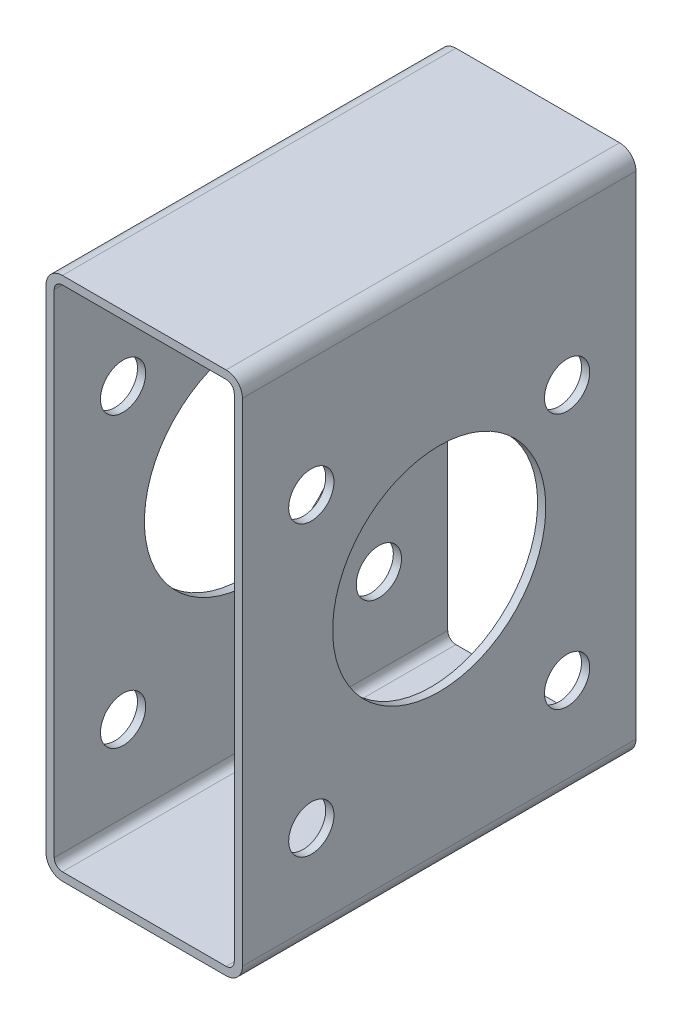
ISO-10303-21;
HEADER;
FILE_DESCRIPTION(('STEP AP214'),'2;1');
FILE_NAME('part.step','',(''),(''),'','','');
FILE_SCHEMA(('AUTOMOTIVE_DESIGN { 1 0 10303 214 1 1 1 1 }'));
ENDSEC;
DATA;
#1=APPLICATION_CONTEXT('core data for automotive mechanical design processes');
#2=APPLICATION_PROTOCOL_DEFINITION('international standard','automotive_design',2000,#1);
#3=PRODUCT_CONTEXT('',#1,'mechanical');
#4=PRODUCT('Part','Part','',(#3));
#5=PRODUCT_RELATED_PRODUCT_CATEGORY('part','',(#4));
#6=PRODUCT_DEFINITION_FORMATION('','',#4);
#7=PRODUCT_DEFINITION_CONTEXT('part definition',#1,'design');
#8=PRODUCT_DEFINITION('design','',#6,#7);
#9=PRODUCT_DEFINITION_SHAPE('','',#8);
#10=(LENGTH_UNIT() NAMED_UNIT(*) SI_UNIT(.MILLI.,.METRE.));
#11=(NAMED_UNIT(*) PLANE_ANGLE_UNIT() SI_UNIT($,.RADIAN.));
#12=(NAMED_UNIT(*) SI_UNIT($,.STERADIAN.) SOLID_ANGLE_UNIT());
#13=UNCERTAINTY_MEASURE_WITH_UNIT(LENGTH_MEASURE(1.E-05),#10,'distance_accuracy_value','');
#14=(GEOMETRIC_REPRESENTATION_CONTEXT(3) GLOBAL_UNCERTAINTY_ASSIGNED_CONTEXT((#13)) GLOBAL_UNIT_ASSIGNED_CONTEXT((#10,
#11,#12)) REPRESENTATION_CONTEXT('',''));
#15=CARTESIAN_POINT('',(0.,0.,0.));
#16=DIRECTION('',(0.,0.,1.));
#17=DIRECTION('',(1.,0.,0.));
#18=AXIS2_PLACEMENT_3D('',#15,#16,#17);
#19=CARTESIAN_POINT('',(-31.75,-82.55,152.4));
#20=DIRECTION('',(0.,0.,1.));
#21=DIRECTION('',(1.,0.,0.));
#22=AXIS2_PLACEMENT_3D('',#19,#20,#21);
#23=PLANE('',#22);
#24=CARTESIAN_POINT('',(-31.75,-82.55,152.4));
#25=DIRECTION('',(0.,0.,1.));
#26=DIRECTION('',(1.,0.,0.));
#27=AXIS2_PLACEMENT_3D('',#24,#25,#26);
#28=CIRCLE('',#27,6.35000000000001);
#29=CARTESIAN_POINT('',(-38.1,-82.55,152.4));
#30=VERTEX_POINT('',#29);
#31=CARTESIAN_POINT('',(-31.75,-88.9,152.4));
#32=VERTEX_POINT('',#31);
#33=EDGE_CURVE('E210',#30,#32,#28,.T.);
#34=ORIENTED_EDGE('',*,*,#33,.T.);
#35=DIRECTION('',(1.,0.,0.));
#36=VECTOR('',#35,1.);
#37=CARTESIAN_POINT('',(-31.75,-88.9,152.4));
#38=LINE('',#37,#36);
#39=CARTESIAN_POINT('',(31.623,-88.9,152.4));
#40=VERTEX_POINT('',#39);
#41=EDGE_CURVE('E213',#32,#40,#38,.T.);
#42=ORIENTED_EDGE('',*,*,#41,.T.);
#43=CARTESIAN_POINT('',(31.623,-82.55,152.4));
#44=DIRECTION('',(0.,0.,1.));
#45=DIRECTION('',(-1.,0.,0.));
#46=AXIS2_PLACEMENT_3D('',#43,#44,#45);
#47=CIRCLE('',#46,6.34999999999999);
#48=CARTESIAN_POINT('',(37.973,-82.55,152.4));
#49=VERTEX_POINT('',#48);
#50=EDGE_CURVE('E216',#40,#49,#47,.T.);
#51=ORIENTED_EDGE('',*,*,#50,.T.);
#52=DIRECTION('',(0.,1.,0.));
#53=VECTOR('',#52,1.);
#54=CARTESIAN_POINT('',(37.973,-82.55,152.4));
#55=LINE('',#54,#53);
#56=CARTESIAN_POINT('',(37.973,107.95,152.4));
#57=VERTEX_POINT('',#56);
#58=EDGE_CURVE('E218',#49,#57,#55,.T.);
#59=ORIENTED_EDGE('',*,*,#58,.T.);
#60=CARTESIAN_POINT('',(31.623,107.95,152.4));
#61=DIRECTION('',(0.,0.,1.));
#62=DIRECTION('',(1.,0.,0.));
#63=AXIS2_PLACEMENT_3D('',#60,#61,#62);
#64=CIRCLE('',#63,6.35);
#65=CARTESIAN_POINT('',(31.623,114.3,152.4));
#66=VERTEX_POINT('',#65);
#67=EDGE_CURVE('E220',#57,#66,#64,.T.);
#68=ORIENTED_EDGE('',*,*,#67,.T.);
#69=DIRECTION('',(-1.,0.,0.));
#70=VECTOR('',#69,1.);
#71=CARTESIAN_POINT('',(-31.75,114.3,152.4));
#72=LINE('',#71,#70);
#73=CARTESIAN_POINT('',(-31.75,114.3,152.4));
#74=VERTEX_POINT('',#73);
#75=EDGE_CURVE('E222',#66,#74,#72,.T.);
#76=ORIENTED_EDGE('',*,*,#75,.T.);
#77=CARTESIAN_POINT('',(-31.75,107.95,152.4));
#78=DIRECTION('',(0.,0.,1.));
#79=DIRECTION('',(1.,0.,0.));
#80=AXIS2_PLACEMENT_3D('',#77,#78,#79);
#81=CIRCLE('',#80,6.35);
#82=CARTESIAN_POINT('',(-38.1,107.95,152.4));
#83=VERTEX_POINT('',#82);
#84=EDGE_CURVE('E224',#74,#83,#81,.T.);
#85=ORIENTED_EDGE('',*,*,#84,.T.);
#86=DIRECTION('',(0.,-1.,0.));
#87=VECTOR('',#86,1.);
#88=CARTESIAN_POINT('',(-38.1,-82.55,152.4));
#89=LINE('',#88,#87);
#90=EDGE_CURVE('E226',#83,#30,#89,.T.);
#91=ORIENTED_EDGE('',*,*,#90,.T.);
#92=EDGE_LOOP('',(#34,#42,#51,#59,#68,#76,#85,#91));
#93=FACE_BOUND('',#92,.T.);
#94=DIRECTION('',(1.,0.,0.));
#95=VECTOR('',#94,1.);
#96=CARTESIAN_POINT('',(-31.75,-85.725,152.4));
#97=LINE('',#96,#95);
#98=CARTESIAN_POINT('',(-31.75,-85.725,152.4));
#99=VERTEX_POINT('',#98);
#100=CARTESIAN_POINT('',(31.623,-85.725,152.4));
#101=VERTEX_POINT('',#100);
#102=EDGE_CURVE('E151',#99,#101,#97,.T.);
#103=ORIENTED_EDGE('',*,*,#102,.F.);
#104=CARTESIAN_POINT('',(-31.75,-82.55,152.4));
#105=DIRECTION('',(0.,0.,1.));
#106=DIRECTION('',(1.,0.,0.));
#107=AXIS2_PLACEMENT_3D('',#104,#105,#106);
#108=CIRCLE('',#107,3.175);
#109=CARTESIAN_POINT('',(-34.925,-82.55,152.4));
#110=VERTEX_POINT('',#109);
#111=EDGE_CURVE('E143',#110,#99,#108,.T.);
#112=ORIENTED_EDGE('',*,*,#111,.F.);
#113=DIRECTION('',(0.,-1.,0.));
#114=VECTOR('',#113,1.);
#115=CARTESIAN_POINT('',(-34.925,-82.55,152.4));
#116=LINE('',#115,#114);
#117=CARTESIAN_POINT('',(-34.925,107.95,152.4));
#118=VERTEX_POINT('',#117);
#119=EDGE_CURVE('E177',#118,#110,#116,.T.);
#120=ORIENTED_EDGE('',*,*,#119,.F.);
#121=CARTESIAN_POINT('',(-31.75,107.95,152.4));
#122=DIRECTION('',(0.,0.,1.));
#123=DIRECTION('',(1.,0.,0.));
#124=AXIS2_PLACEMENT_3D('',#121,#122,#123);
#125=CIRCLE('',#124,3.175);
#126=CARTESIAN_POINT('',(-31.75,111.125,152.4));
#127=VERTEX_POINT('',#126);
#128=EDGE_CURVE('E175',#127,#118,#125,.T.);
#129=ORIENTED_EDGE('',*,*,#128,.F.);
#130=DIRECTION('',(-1.,0.,0.));
#131=VECTOR('',#130,1.);
#132=CARTESIAN_POINT('',(-31.75,111.125,152.4));
#133=LINE('',#132,#131);
#134=CARTESIAN_POINT('',(31.623,111.125,152.4));
#135=VERTEX_POINT('',#134);
#136=EDGE_CURVE('E173',#135,#127,#133,.T.);
#137=ORIENTED_EDGE('',*,*,#136,.F.);
#138=CARTESIAN_POINT('',(31.623,107.95,152.4));
#139=DIRECTION('',(0.,0.,1.));
#140=DIRECTION('',(1.,0.,0.));
#141=AXIS2_PLACEMENT_3D('',#138,#139,#140);
#142=CIRCLE('',#141,3.175);
#143=CARTESIAN_POINT('',(34.798,107.95,152.4));
#144=VERTEX_POINT('',#143);
#145=EDGE_CURVE('E171',#144,#135,#142,.T.);
#146=ORIENTED_EDGE('',*,*,#145,.F.);
#147=DIRECTION('',(0.,1.,0.));
#148=VECTOR('',#147,1.);
#149=CARTESIAN_POINT('',(34.798,-82.55,152.4));
#150=LINE('',#149,#148);
#151=CARTESIAN_POINT('',(34.798,-82.55,152.4));
#152=VERTEX_POINT('',#151);
#153=EDGE_CURVE('E166',#152,#144,#150,.T.);
#154=ORIENTED_EDGE('',*,*,#153,.F.);
#155=CARTESIAN_POINT('',(31.623,-82.55,152.4));
#156=DIRECTION('',(0.,0.,1.));
#157=DIRECTION('',(-1.,0.,0.));
#158=AXIS2_PLACEMENT_3D('',#155,#156,#157);
#159=CIRCLE('',#158,3.17500000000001);
#160=EDGE_CURVE('E164',#101,#152,#159,.T.);
#161=ORIENTED_EDGE('',*,*,#160,.F.);
#162=EDGE_LOOP('',(#103,#112,#120,#129,#137,#146,#154,#161));
#163=FACE_BOUND('',#162,.T.);
#164=ADVANCED_FACE('F30',(#93,#163),#23,.T.);
#165=CARTESIAN_POINT('',(-31.75,-82.55,0.));
#166=DIRECTION('',(0.,0.,1.));
#167=DIRECTION('',(1.,0.,0.));
#168=AXIS2_PLACEMENT_3D('',#165,#166,#167);
#169=PLANE('',#168);
#170=CARTESIAN_POINT('',(-31.75,-82.55,0.));
#171=DIRECTION('',(0.,0.,1.));
#172=DIRECTION('',(1.,0.,0.));
#173=AXIS2_PLACEMENT_3D('',#170,#171,#172);
#174=CIRCLE('',#173,6.35000000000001);
#175=CARTESIAN_POINT('',(-38.1,-82.55,0.));
#176=VERTEX_POINT('',#175);
#177=CARTESIAN_POINT('',(-31.75,-88.9,0.));
#178=VERTEX_POINT('',#177);
#179=EDGE_CURVE('E159',#176,#178,#174,.T.);
#180=ORIENTED_EDGE('',*,*,#179,.F.);
#181=DIRECTION('',(0.,-1.,0.));
#182=VECTOR('',#181,1.);
#183=CARTESIAN_POINT('',(-38.1,-82.55,0.));
#184=LINE('',#183,#182);
#185=CARTESIAN_POINT('',(-38.1,107.95,0.));
#186=VERTEX_POINT('',#185);
#187=EDGE_CURVE('E214',#186,#176,#184,.T.);
#188=ORIENTED_EDGE('',*,*,#187,.F.);
#189=CARTESIAN_POINT('',(-31.75,107.95,0.));
#190=DIRECTION('',(0.,0.,1.));
#191=DIRECTION('',(1.,0.,0.));
#192=AXIS2_PLACEMENT_3D('',#189,#190,#191);
#193=CIRCLE('',#192,6.35);
#194=CARTESIAN_POINT('',(-31.75,114.3,0.));
#195=VERTEX_POINT('',#194);
#196=EDGE_CURVE('E241',#195,#186,#193,.T.);
#197=ORIENTED_EDGE('',*,*,#196,.F.);
#198=DIRECTION('',(-1.,0.,0.));
#199=VECTOR('',#198,1.);
#200=CARTESIAN_POINT('',(-31.75,114.3,0.));
#201=LINE('',#200,#199);
#202=CARTESIAN_POINT('',(31.623,114.3,0.));
#203=VERTEX_POINT('',#202);
#204=EDGE_CURVE('E239',#203,#195,#201,.T.);
#205=ORIENTED_EDGE('',*,*,#204,.F.);
#206=CARTESIAN_POINT('',(31.623,107.95,0.));
#207=DIRECTION('',(0.,0.,1.));
#208=DIRECTION('',(1.,0.,0.));
#209=AXIS2_PLACEMENT_3D('',#206,#207,#208);
#210=CIRCLE('',#209,6.35);
#211=CARTESIAN_POINT('',(37.973,107.95,0.));
#212=VERTEX_POINT('',#211);
#213=EDGE_CURVE('E237',#212,#203,#210,.T.);
#214=ORIENTED_EDGE('',*,*,#213,.F.);
#215=DIRECTION('',(0.,1.,0.));
#216=VECTOR('',#215,1.);
#217=CARTESIAN_POINT('',(37.973,-82.55,0.));
#218=LINE('',#217,#216);
#219=CARTESIAN_POINT('',(37.973,-82.55,0.));
#220=VERTEX_POINT('',#219);
#221=EDGE_CURVE('E235',#220,#212,#218,.T.);
#222=ORIENTED_EDGE('',*,*,#221,.F.);
#223=CARTESIAN_POINT('',(31.623,-82.55,0.));
#224=DIRECTION('',(0.,0.,1.));
#225=DIRECTION('',(-1.,0.,0.));
#226=AXIS2_PLACEMENT_3D('',#223,#224,#225);
#227=CIRCLE('',#226,6.34999999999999);
#228=CARTESIAN_POINT('',(31.623,-88.9,0.));
#229=VERTEX_POINT('',#228);
#230=EDGE_CURVE('E233',#229,#220,#227,.T.);
#231=ORIENTED_EDGE('',*,*,#230,.F.);
#232=DIRECTION('',(1.,0.,0.));
#233=VECTOR('',#232,1.);
#234=CARTESIAN_POINT('',(-31.75,-88.9,0.));
#235=LINE('',#234,#233);
#236=EDGE_CURVE('E231',#178,#229,#235,.T.);
#237=ORIENTED_EDGE('',*,*,#236,.F.);
#238=EDGE_LOOP('',(#180,#188,#197,#205,#214,#222,#231,#237));
#239=FACE_BOUND('',#238,.T.);
#240=CARTESIAN_POINT('',(-31.75,-82.55,0.));
#241=DIRECTION('',(0.,0.,1.));
#242=DIRECTION('',(1.,0.,0.));
#243=AXIS2_PLACEMENT_3D('',#240,#241,#242);
#244=CIRCLE('',#243,3.175);
#245=CARTESIAN_POINT('',(-34.925,-82.55,0.));
#246=VERTEX_POINT('',#245);
#247=CARTESIAN_POINT('',(-31.75,-85.725,0.));
#248=VERTEX_POINT('',#247);
#249=EDGE_CURVE('E53',#246,#248,#244,.T.);
#250=ORIENTED_EDGE('',*,*,#249,.T.);
#251=DIRECTION('',(1.,0.,0.));
#252=VECTOR('',#251,1.);
#253=CARTESIAN_POINT('',(-31.75,-85.725,0.));
#254=LINE('',#253,#252);
#255=CARTESIAN_POINT('',(31.623,-85.725,0.));
#256=VERTEX_POINT('',#255);
#257=EDGE_CURVE('E158',#248,#256,#254,.T.);
#258=ORIENTED_EDGE('',*,*,#257,.T.);
#259=CARTESIAN_POINT('',(31.623,-82.55,0.));
#260=DIRECTION('',(0.,0.,1.));
#261=DIRECTION('',(-1.,0.,0.));
#262=AXIS2_PLACEMENT_3D('',#259,#260,#261);
#263=CIRCLE('',#262,3.17500000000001);
#264=CARTESIAN_POINT('',(34.798,-82.55,0.));
#265=VERTEX_POINT('',#264);
#266=EDGE_CURVE('E182',#256,#265,#263,.T.);
#267=ORIENTED_EDGE('',*,*,#266,.T.);
#268=DIRECTION('',(0.,1.,0.));
#269=VECTOR('',#268,1.);
#270=CARTESIAN_POINT('',(34.798,-82.55,0.));
#271=LINE('',#270,#269);
#272=CARTESIAN_POINT('',(34.798,107.95,0.));
#273=VERTEX_POINT('',#272);
#274=EDGE_CURVE('E185',#265,#273,#271,.T.);
#275=ORIENTED_EDGE('',*,*,#274,.T.);
#276=CARTESIAN_POINT('',(31.623,107.95,0.));
#277=DIRECTION('',(0.,0.,1.));
#278=DIRECTION('',(1.,0.,0.));
#279=AXIS2_PLACEMENT_3D('',#276,#277,#278);
#280=CIRCLE('',#279,3.175);
#281=CARTESIAN_POINT('',(31.623,111.125,0.));
#282=VERTEX_POINT('',#281);
#283=EDGE_CURVE('E188',#273,#282,#280,.T.);
#284=ORIENTED_EDGE('',*,*,#283,.T.);
#285=DIRECTION('',(-1.,0.,0.));
#286=VECTOR('',#285,1.);
#287=CARTESIAN_POINT('',(-31.75,111.125,0.));
#288=LINE('',#287,#286);
#289=CARTESIAN_POINT('',(-31.75,111.125,0.));
#290=VERTEX_POINT('',#289);
#291=EDGE_CURVE('E191',#282,#290,#288,.T.);
#292=ORIENTED_EDGE('',*,*,#291,.T.);
#293=CARTESIAN_POINT('',(-31.75,107.95,0.));
#294=DIRECTION('',(0.,0.,1.));
#295=DIRECTION('',(1.,0.,0.));
#296=AXIS2_PLACEMENT_3D('',#293,#294,#295);
#297=CIRCLE('',#296,3.175);
#298=CARTESIAN_POINT('',(-34.925,107.95,0.));
#299=VERTEX_POINT('',#298);
#300=EDGE_CURVE('E194',#290,#299,#297,.T.);
#301=ORIENTED_EDGE('',*,*,#300,.T.);
#302=DIRECTION('',(0.,-1.,0.));
#303=VECTOR('',#302,1.);
#304=CARTESIAN_POINT('',(-34.925,-82.55,0.));
#305=LINE('',#304,#303);
#306=EDGE_CURVE('E152',#299,#246,#305,.T.);
#307=ORIENTED_EDGE('',*,*,#306,.T.);
#308=EDGE_LOOP('',(#250,#258,#267,#275,#284,#292,#301,#307));
#309=FACE_BOUND('',#308,.T.);
#310=ADVANCED_FACE('F271',(#239,#309),#169,.F.);
#311=CARTESIAN_POINT('',(-31.75,-82.55,152.4));
#312=DIRECTION('',(0.,0.,-1.));
#313=DIRECTION('',(-1.,0.,0.));
#314=AXIS2_PLACEMENT_3D('',#311,#312,#313);
#315=CYLINDRICAL_SURFACE('',#314,6.35000000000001);
#316=ORIENTED_EDGE('',*,*,#179,.T.);
#317=DIRECTION('',(0.,0.,-1.));
#318=VECTOR('',#317,1.);
#319=CARTESIAN_POINT('',(-31.75,-88.9,152.4));
#320=LINE('',#319,#318);
#321=EDGE_CURVE('E11',#32,#178,#320,.T.);
#322=ORIENTED_EDGE('',*,*,#321,.F.);
#323=ORIENTED_EDGE('',*,*,#33,.F.);
#324=DIRECTION('',(0.,0.,-1.));
#325=VECTOR('',#324,1.);
#326=CARTESIAN_POINT('',(-38.1,-82.55,152.4));
#327=LINE('',#326,#325);
#328=EDGE_CURVE('E228',#30,#176,#327,.T.);
#329=ORIENTED_EDGE('',*,*,#328,.T.);
#330=EDGE_LOOP('',(#316,#322,#323,#329));
#331=FACE_BOUND('',#330,.T.);
#332=ADVANCED_FACE('F32',(#331),#315,.T.);
#333=CARTESIAN_POINT('',(-31.75,-88.9,152.4));
#334=DIRECTION('',(0.,1.,0.));
#335=DIRECTION('',(-1.,0.,0.));
#336=AXIS2_PLACEMENT_3D('',#333,#334,#335);
#337=PLANE('',#336);
#338=ORIENTED_EDGE('',*,*,#236,.T.);
#339=DIRECTION('',(0.,0.,-1.));
#340=VECTOR('',#339,1.);
#341=CARTESIAN_POINT('',(31.623,-88.9,152.4));
#342=LINE('',#341,#340);
#343=EDGE_CURVE('E38',#40,#229,#342,.T.);
#344=ORIENTED_EDGE('',*,*,#343,.F.);
#345=ORIENTED_EDGE('',*,*,#41,.F.);
#346=ORIENTED_EDGE('',*,*,#321,.T.);
#347=EDGE_LOOP('',(#338,#344,#345,#346));
#348=FACE_BOUND('',#347,.T.);
#349=ADVANCED_FACE('F288',(#348),#337,.F.);
#350=CARTESIAN_POINT('',(31.623,-82.55,152.4));
#351=DIRECTION('',(0.,0.,-1.));
#352=DIRECTION('',(-1.,0.,0.));
#353=AXIS2_PLACEMENT_3D('',#350,#351,#352);
#354=CYLINDRICAL_SURFACE('',#353,6.34999999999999);
#355=ORIENTED_EDGE('',*,*,#230,.T.);
#356=DIRECTION('',(0.,0.,-1.));
#357=VECTOR('',#356,1.);
#358=CARTESIAN_POINT('',(37.973,-82.55,152.4));
#359=LINE('',#358,#357);
#360=EDGE_CURVE('E258',#49,#220,#359,.T.);
#361=ORIENTED_EDGE('',*,*,#360,.F.);
#362=ORIENTED_EDGE('',*,*,#50,.F.);
#363=ORIENTED_EDGE('',*,*,#343,.T.);
#364=EDGE_LOOP('',(#355,#361,#362,#363));
#365=FACE_BOUND('',#364,.T.);
#366=ADVANCED_FACE('F265',(#365),#354,.T.);
#367=CARTESIAN_POINT('',(37.973,-82.55,152.4));
#368=DIRECTION('',(-1.,0.,0.));
#369=DIRECTION('',(0.,-1.,0.));
#370=AXIS2_PLACEMENT_3D('',#367,#368,#369);
#371=PLANE('',#370);
#372=CARTESIAN_POINT('',(37.973,-49.53,26.67));
#373=DIRECTION('',(1.,0.,0.));
#374=DIRECTION('',(0.,1.,0.));
#375=AXIS2_PLACEMENT_3D('',#372,#373,#374);
#376=CIRCLE('',#375,8.76299999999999);
#377=CARTESIAN_POINT('',(37.973,-40.767,26.67));
#378=VERTEX_POINT('',#377);
#379=EDGE_CURVE('E348',#378,#378,#376,.T.);
#380=ORIENTED_EDGE('',*,*,#379,.F.);
#381=EDGE_LOOP('',(#380));
#382=FACE_BOUND('',#381,.T.);
#383=CARTESIAN_POINT('',(37.973,-49.53,125.73));
#384=DIRECTION('',(1.,0.,0.));
#385=DIRECTION('',(0.,1.,0.));
#386=AXIS2_PLACEMENT_3D('',#383,#384,#385);
#387=CIRCLE('',#386,8.76299999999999);
#388=CARTESIAN_POINT('',(37.973,-40.767,125.73));
#389=VERTEX_POINT('',#388);
#390=EDGE_CURVE('E361',#389,#389,#387,.T.);
#391=ORIENTED_EDGE('',*,*,#390,.F.);
#392=EDGE_LOOP('',(#391));
#393=FACE_BOUND('',#392,.T.);
#394=CARTESIAN_POINT('',(37.973,49.53,26.67));
#395=DIRECTION('',(1.,0.,0.));
#396=DIRECTION('',(0.,1.,0.));
#397=AXIS2_PLACEMENT_3D('',#394,#395,#396);
#398=CIRCLE('',#397,8.76299999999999);
#399=CARTESIAN_POINT('',(37.973,58.293,26.67));
#400=VERTEX_POINT('',#399);
#401=EDGE_CURVE('E367',#400,#400,#398,.T.);
#402=ORIENTED_EDGE('',*,*,#401,.F.);
#403=EDGE_LOOP('',(#402));
#404=FACE_BOUND('',#403,.T.);
#405=CARTESIAN_POINT('',(37.973,62.23,125.73));
#406=DIRECTION('',(1.,0.,0.));
#407=DIRECTION('',(0.,1.,0.));
#408=AXIS2_PLACEMENT_3D('',#405,#406,#407);
#409=CIRCLE('',#408,8.76299999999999);
#410=CARTESIAN_POINT('',(37.973,70.993,125.73));
#411=VERTEX_POINT('',#410);
#412=EDGE_CURVE('E373',#411,#411,#409,.T.);
#413=ORIENTED_EDGE('',*,*,#412,.F.);
#414=EDGE_LOOP('',(#413));
#415=FACE_BOUND('',#414,.T.);
#416=CARTESIAN_POINT('',(37.973,12.7,76.2));
#417=DIRECTION('',(1.,0.,0.));
#418=DIRECTION('',(0.,1.,0.));
#419=AXIS2_PLACEMENT_3D('',#416,#417,#418);
#420=CIRCLE('',#419,41.275);
#421=CARTESIAN_POINT('',(37.973,53.975,76.2));
#422=VERTEX_POINT('',#421);
#423=EDGE_CURVE('E180',#422,#422,#420,.T.);
#424=ORIENTED_EDGE('',*,*,#423,.F.);
#425=EDGE_LOOP('',(#424));
#426=FACE_BOUND('',#425,.T.);
#427=ORIENTED_EDGE('',*,*,#221,.T.);
#428=DIRECTION('',(0.,0.,-1.));
#429=VECTOR('',#428,1.);
#430=CARTESIAN_POINT('',(37.973,107.95,152.4));
#431=LINE('',#430,#429);
#432=EDGE_CURVE('E255',#57,#212,#431,.T.);
#433=ORIENTED_EDGE('',*,*,#432,.F.);
#434=ORIENTED_EDGE('',*,*,#58,.F.);
#435=ORIENTED_EDGE('',*,*,#360,.T.);
#436=EDGE_LOOP('',(#427,#433,#434,#435));
#437=FACE_BOUND('',#436,.T.);
#438=ADVANCED_FACE('F277',(#382,#393,#404,#415,#426,#437),#371,.F.);
#439=CARTESIAN_POINT('',(31.623,107.95,152.4));
#440=DIRECTION('',(0.,0.,-1.));
#441=DIRECTION('',(-1.,0.,0.));
#442=AXIS2_PLACEMENT_3D('',#439,#440,#441);
#443=CYLINDRICAL_SURFACE('',#442,6.35);
#444=ORIENTED_EDGE('',*,*,#213,.T.);
#445=DIRECTION('',(0.,0.,-1.));
#446=VECTOR('',#445,1.);
#447=CARTESIAN_POINT('',(31.623,114.3,152.4));
#448=LINE('',#447,#446);
#449=EDGE_CURVE('E252',#66,#203,#448,.T.);
#450=ORIENTED_EDGE('',*,*,#449,.F.);
#451=ORIENTED_EDGE('',*,*,#67,.F.);
#452=ORIENTED_EDGE('',*,*,#432,.T.);
#453=EDGE_LOOP('',(#444,#450,#451,#452));
#454=FACE_BOUND('',#453,.T.);
#455=ADVANCED_FACE('F281',(#454),#443,.T.);
#456=CARTESIAN_POINT('',(-31.75,114.3,152.4));
#457=DIRECTION('',(0.,-1.,0.));
#458=DIRECTION('',(0.,0.,-1.));
#459=AXIS2_PLACEMENT_3D('',#456,#457,#458);
#460=PLANE('',#459);
#461=ORIENTED_EDGE('',*,*,#204,.T.);
#462=DIRECTION('',(0.,0.,-1.));
#463=VECTOR('',#462,1.);
#464=CARTESIAN_POINT('',(-31.75,114.3,152.4));
#465=LINE('',#464,#463);
#466=EDGE_CURVE('E249',#74,#195,#465,.T.);
#467=ORIENTED_EDGE('',*,*,#466,.F.);
#468=ORIENTED_EDGE('',*,*,#75,.F.);
#469=ORIENTED_EDGE('',*,*,#449,.T.);
#470=EDGE_LOOP('',(#461,#467,#468,#469));
#471=FACE_BOUND('',#470,.T.);
#472=ADVANCED_FACE('F301',(#471),#460,.F.);
#473=CARTESIAN_POINT('',(-31.75,107.95,152.4));
#474=DIRECTION('',(0.,0.,-1.));
#475=DIRECTION('',(-1.,0.,0.));
#476=AXIS2_PLACEMENT_3D('',#473,#474,#475);
#477=CYLINDRICAL_SURFACE('',#476,6.35);
#478=ORIENTED_EDGE('',*,*,#196,.T.);
#479=DIRECTION('',(0.,0.,-1.));
#480=VECTOR('',#479,1.);
#481=CARTESIAN_POINT('',(-38.1,107.95,152.4));
#482=LINE('',#481,#480);
#483=EDGE_CURVE('E246',#83,#186,#482,.T.);
#484=ORIENTED_EDGE('',*,*,#483,.F.);
#485=ORIENTED_EDGE('',*,*,#84,.F.);
#486=ORIENTED_EDGE('',*,*,#466,.T.);
#487=EDGE_LOOP('',(#478,#484,#485,#486));
#488=FACE_BOUND('',#487,.T.);
#489=ADVANCED_FACE('F299',(#488),#477,.T.);
#490=CARTESIAN_POINT('',(-38.1,-82.55,152.4));
#491=DIRECTION('',(1.,0.,0.));
#492=DIRECTION('',(0.,1.,0.));
#493=AXIS2_PLACEMENT_3D('',#490,#491,#492);
#494=PLANE('',#493);
#495=CARTESIAN_POINT('',(-38.1,-49.53,125.73));
#496=DIRECTION('',(-1.,0.,0.));
#497=DIRECTION('',(0.,-1.,0.));
#498=AXIS2_PLACEMENT_3D('',#495,#496,#497);
#499=CIRCLE('',#498,8.76299999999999);
#500=CARTESIAN_POINT('',(-38.1,-58.293,125.73));
#501=VERTEX_POINT('',#500);
#502=EDGE_CURVE('E327',#501,#501,#499,.T.);
#503=ORIENTED_EDGE('',*,*,#502,.F.);
#504=EDGE_LOOP('',(#503));
#505=FACE_BOUND('',#504,.T.);
#506=CARTESIAN_POINT('',(-38.1,-49.53,26.67));
#507=DIRECTION('',(-1.,0.,0.));
#508=DIRECTION('',(0.,-1.,0.));
#509=AXIS2_PLACEMENT_3D('',#506,#507,#508);
#510=CIRCLE('',#509,8.76299999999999);
#511=CARTESIAN_POINT('',(-38.1,-58.293,26.67));
#512=VERTEX_POINT('',#511);
#513=EDGE_CURVE('E331',#512,#512,#510,.T.);
#514=ORIENTED_EDGE('',*,*,#513,.F.);
#515=EDGE_LOOP('',(#514));
#516=FACE_BOUND('',#515,.T.);
#517=CARTESIAN_POINT('',(-38.1,62.23,125.73));
#518=DIRECTION('',(-1.,0.,0.));
#519=DIRECTION('',(0.,-1.,0.));
#520=AXIS2_PLACEMENT_3D('',#517,#518,#519);
#521=CIRCLE('',#520,8.76299999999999);
#522=CARTESIAN_POINT('',(-38.1,53.467,125.73));
#523=VERTEX_POINT('',#522);
#524=EDGE_CURVE('E335',#523,#523,#521,.T.);
#525=ORIENTED_EDGE('',*,*,#524,.F.);
#526=EDGE_LOOP('',(#525));
#527=FACE_BOUND('',#526,.T.);
#528=CARTESIAN_POINT('',(-38.1,49.53,26.67));
#529=DIRECTION('',(-1.,0.,0.));
#530=DIRECTION('',(0.,-1.,0.));
#531=AXIS2_PLACEMENT_3D('',#528,#529,#530);
#532=CIRCLE('',#531,8.76299999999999);
#533=CARTESIAN_POINT('',(-38.1,40.767,26.67));
#534=VERTEX_POINT('',#533);
#535=EDGE_CURVE('E339',#534,#534,#532,.T.);
#536=ORIENTED_EDGE('',*,*,#535,.F.);
#537=EDGE_LOOP('',(#536));
#538=FACE_BOUND('',#537,.T.);
#539=CARTESIAN_POINT('',(-38.1,12.7,76.2));
#540=DIRECTION('',(-1.,0.,0.));
#541=DIRECTION('',(0.,-1.,0.));
#542=AXIS2_PLACEMENT_3D('',#539,#540,#541);
#543=CIRCLE('',#542,41.275);
#544=CARTESIAN_POINT('',(-38.1,-28.575,76.2));
#545=VERTEX_POINT('',#544);
#546=EDGE_CURVE('E342',#545,#545,#543,.T.);
#547=ORIENTED_EDGE('',*,*,#546,.F.);
#548=EDGE_LOOP('',(#547));
#549=FACE_BOUND('',#548,.T.);
#550=ORIENTED_EDGE('',*,*,#187,.T.);
#551=ORIENTED_EDGE('',*,*,#328,.F.);
#552=ORIENTED_EDGE('',*,*,#90,.F.);
#553=ORIENTED_EDGE('',*,*,#483,.T.);
#554=EDGE_LOOP('',(#550,#551,#552,#553));
#555=FACE_BOUND('',#554,.T.);
#556=ADVANCED_FACE('F294',(#505,#516,#527,#538,#549,#555),#494,.F.);
#557=CARTESIAN_POINT('',(-31.75,-82.55,152.4));
#558=DIRECTION('',(0.,0.,-1.));
#559=DIRECTION('',(-1.,0.,0.));
#560=AXIS2_PLACEMENT_3D('',#557,#558,#559);
#561=CYLINDRICAL_SURFACE('',#560,3.175);
#562=ORIENTED_EDGE('',*,*,#249,.F.);
#563=DIRECTION('',(0.,0.,-1.));
#564=VECTOR('',#563,1.);
#565=CARTESIAN_POINT('',(-34.925,-82.55,152.4));
#566=LINE('',#565,#564);
#567=EDGE_CURVE('E147',#110,#246,#566,.T.);
#568=ORIENTED_EDGE('',*,*,#567,.F.);
#569=ORIENTED_EDGE('',*,*,#111,.T.);
#570=DIRECTION('',(0.,0.,-1.));
#571=VECTOR('',#570,1.);
#572=CARTESIAN_POINT('',(-31.75,-85.725,152.4));
#573=LINE('',#572,#571);
#574=EDGE_CURVE('E146',#99,#248,#573,.T.);
#575=ORIENTED_EDGE('',*,*,#574,.T.);
#576=EDGE_LOOP('',(#562,#568,#569,#575));
#577=FACE_BOUND('',#576,.T.);
#578=ADVANCED_FACE('F145',(#577),#561,.F.);
#579=CARTESIAN_POINT('',(-31.75,-85.725,152.4));
#580=DIRECTION('',(0.,1.,0.));
#581=DIRECTION('',(-1.,0.,0.));
#582=AXIS2_PLACEMENT_3D('',#579,#580,#581);
#583=PLANE('',#582);
#584=ORIENTED_EDGE('',*,*,#257,.F.);
#585=ORIENTED_EDGE('',*,*,#574,.F.);
#586=ORIENTED_EDGE('',*,*,#102,.T.);
#587=DIRECTION('',(0.,0.,-1.));
#588=VECTOR('',#587,1.);
#589=CARTESIAN_POINT('',(31.623,-85.725,152.4));
#590=LINE('',#589,#588);
#591=EDGE_CURVE('E160',#101,#256,#590,.T.);
#592=ORIENTED_EDGE('',*,*,#591,.T.);
#593=EDGE_LOOP('',(#584,#585,#586,#592));
#594=FACE_BOUND('',#593,.T.);
#595=ADVANCED_FACE('F155',(#594),#583,.T.);
#596=CARTESIAN_POINT('',(31.623,-82.55,152.4));
#597=DIRECTION('',(0.,0.,-1.));
#598=DIRECTION('',(-1.,0.,0.));
#599=AXIS2_PLACEMENT_3D('',#596,#597,#598);
#600=CYLINDRICAL_SURFACE('',#599,3.17500000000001);
#601=ORIENTED_EDGE('',*,*,#266,.F.);
#602=ORIENTED_EDGE('',*,*,#591,.F.);
#603=ORIENTED_EDGE('',*,*,#160,.T.);
#604=DIRECTION('',(0.,0.,-1.));
#605=VECTOR('',#604,1.);
#606=CARTESIAN_POINT('',(34.798,-82.55,152.4));
#607=LINE('',#606,#605);
#608=EDGE_CURVE('E207',#152,#265,#607,.T.);
#609=ORIENTED_EDGE('',*,*,#608,.T.);
#610=EDGE_LOOP('',(#601,#602,#603,#609));
#611=FACE_BOUND('',#610,.T.);
#612=ADVANCED_FACE('F458',(#611),#600,.F.);
#613=CARTESIAN_POINT('',(34.798,-82.55,152.4));
#614=DIRECTION('',(-1.,0.,0.));
#615=DIRECTION('',(0.,-1.,0.));
#616=AXIS2_PLACEMENT_3D('',#613,#614,#615);
#617=PLANE('',#616);
#618=CARTESIAN_POINT('',(34.798,-49.53,26.67));
#619=DIRECTION('',(-1.,0.,0.));
#620=DIRECTION('',(0.,-1.,0.));
#621=AXIS2_PLACEMENT_3D('',#618,#619,#620);
#622=CIRCLE('',#621,8.76299999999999);
#623=CARTESIAN_POINT('',(34.798,-58.293,26.67));
#624=VERTEX_POINT('',#623);
#625=EDGE_CURVE('E344',#624,#624,#622,.F.);
#626=ORIENTED_EDGE('',*,*,#625,.T.);
#627=EDGE_LOOP('',(#626));
#628=FACE_BOUND('',#627,.T.);
#629=CARTESIAN_POINT('',(34.798,-49.53,125.73));
#630=DIRECTION('',(-1.,0.,0.));
#631=DIRECTION('',(0.,-1.,0.));
#632=AXIS2_PLACEMENT_3D('',#629,#630,#631);
#633=CIRCLE('',#632,8.76299999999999);
#634=CARTESIAN_POINT('',(34.798,-58.293,125.73));
#635=VERTEX_POINT('',#634);
#636=EDGE_CURVE('E358',#635,#635,#633,.F.);
#637=ORIENTED_EDGE('',*,*,#636,.T.);
#638=EDGE_LOOP('',(#637));
#639=FACE_BOUND('',#638,.T.);
#640=CARTESIAN_POINT('',(34.798,49.53,26.67));
#641=DIRECTION('',(-1.,0.,0.));
#642=DIRECTION('',(0.,-1.,0.));
#643=AXIS2_PLACEMENT_3D('',#640,#641,#642);
#644=CIRCLE('',#643,8.76299999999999);
#645=CARTESIAN_POINT('',(34.798,40.767,26.67));
#646=VERTEX_POINT('',#645);
#647=EDGE_CURVE('E364',#646,#646,#644,.F.);
#648=ORIENTED_EDGE('',*,*,#647,.T.);
#649=EDGE_LOOP('',(#648));
#650=FACE_BOUND('',#649,.T.);
#651=CARTESIAN_POINT('',(34.798,62.23,125.73));
#652=DIRECTION('',(-1.,0.,0.));
#653=DIRECTION('',(0.,-1.,0.));
#654=AXIS2_PLACEMENT_3D('',#651,#652,#653);
#655=CIRCLE('',#654,8.76299999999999);
#656=CARTESIAN_POINT('',(34.798,53.467,125.73));
#657=VERTEX_POINT('',#656);
#658=EDGE_CURVE('E370',#657,#657,#655,.F.);
#659=ORIENTED_EDGE('',*,*,#658,.T.);
#660=EDGE_LOOP('',(#659));
#661=FACE_BOUND('',#660,.T.);
#662=CARTESIAN_POINT('',(34.798,12.7,76.2));
#663=DIRECTION('',(-1.,0.,0.));
#664=DIRECTION('',(0.,-1.,0.));
#665=AXIS2_PLACEMENT_3D('',#662,#663,#664);
#666=CIRCLE('',#665,41.275);
#667=CARTESIAN_POINT('',(34.798,-28.575,76.2));
#668=VERTEX_POINT('',#667);
#669=EDGE_CURVE('E376',#668,#668,#666,.F.);
#670=ORIENTED_EDGE('',*,*,#669,.T.);
#671=EDGE_LOOP('',(#670));
#672=FACE_BOUND('',#671,.T.);
#673=ORIENTED_EDGE('',*,*,#274,.F.);
#674=ORIENTED_EDGE('',*,*,#608,.F.);
#675=ORIENTED_EDGE('',*,*,#153,.T.);
#676=DIRECTION('',(0.,0.,-1.));
#677=VECTOR('',#676,1.);
#678=CARTESIAN_POINT('',(34.798,107.95,152.4));
#679=LINE('',#678,#677);
#680=EDGE_CURVE('E205',#144,#273,#679,.T.);
#681=ORIENTED_EDGE('',*,*,#680,.T.);
#682=EDGE_LOOP('',(#673,#674,#675,#681));
#683=FACE_BOUND('',#682,.T.);
#684=ADVANCED_FACE('F465',(#628,#639,#650,#661,#672,#683),#617,.T.);
#685=CARTESIAN_POINT('',(31.623,107.95,152.4));
#686=DIRECTION('',(0.,0.,-1.));
#687=DIRECTION('',(-1.,0.,0.));
#688=AXIS2_PLACEMENT_3D('',#685,#686,#687);
#689=CYLINDRICAL_SURFACE('',#688,3.175);
#690=ORIENTED_EDGE('',*,*,#283,.F.);
#691=ORIENTED_EDGE('',*,*,#680,.F.);
#692=ORIENTED_EDGE('',*,*,#145,.T.);
#693=DIRECTION('',(0.,0.,-1.));
#694=VECTOR('',#693,1.);
#695=CARTESIAN_POINT('',(31.623,111.125,152.4));
#696=LINE('',#695,#694);
#697=EDGE_CURVE('E203',#135,#282,#696,.T.);
#698=ORIENTED_EDGE('',*,*,#697,.T.);
#699=EDGE_LOOP('',(#690,#691,#692,#698));
#700=FACE_BOUND('',#699,.T.);
#701=ADVANCED_FACE('F474',(#700),#689,.F.);
#702=CARTESIAN_POINT('',(-31.75,111.125,152.4));
#703=DIRECTION('',(0.,-1.,0.));
#704=DIRECTION('',(1.,0.,0.));
#705=AXIS2_PLACEMENT_3D('',#702,#703,#704);
#706=PLANE('',#705);
#707=ORIENTED_EDGE('',*,*,#291,.F.);
#708=ORIENTED_EDGE('',*,*,#697,.F.);
#709=ORIENTED_EDGE('',*,*,#136,.T.);
#710=DIRECTION('',(0.,0.,-1.));
#711=VECTOR('',#710,1.);
#712=CARTESIAN_POINT('',(-31.75,111.125,152.4));
#713=LINE('',#712,#711);
#714=EDGE_CURVE('E201',#127,#290,#713,.T.);
#715=ORIENTED_EDGE('',*,*,#714,.T.);
#716=EDGE_LOOP('',(#707,#708,#709,#715));
#717=FACE_BOUND('',#716,.T.);
#718=ADVANCED_FACE('F483',(#717),#706,.T.);
#719=CARTESIAN_POINT('',(-31.75,107.95,152.4));
#720=DIRECTION('',(0.,0.,-1.));
#721=DIRECTION('',(-1.,0.,0.));
#722=AXIS2_PLACEMENT_3D('',#719,#720,#721);
#723=CYLINDRICAL_SURFACE('',#722,3.175);
#724=ORIENTED_EDGE('',*,*,#300,.F.);
#725=ORIENTED_EDGE('',*,*,#714,.F.);
#726=ORIENTED_EDGE('',*,*,#128,.T.);
#727=DIRECTION('',(0.,0.,-1.));
#728=VECTOR('',#727,1.);
#729=CARTESIAN_POINT('',(-34.925,107.95,152.4));
#730=LINE('',#729,#728);
#731=EDGE_CURVE('E45',#118,#299,#730,.T.);
#732=ORIENTED_EDGE('',*,*,#731,.T.);
#733=EDGE_LOOP('',(#724,#725,#726,#732));
#734=FACE_BOUND('',#733,.T.);
#735=ADVANCED_FACE('F492',(#734),#723,.F.);
#736=CARTESIAN_POINT('',(-34.925,-82.55,152.4));
#737=DIRECTION('',(1.,0.,0.));
#738=DIRECTION('',(0.,1.,0.));
#739=AXIS2_PLACEMENT_3D('',#736,#737,#738);
#740=PLANE('',#739);
#741=CARTESIAN_POINT('',(-34.925,-49.53,125.73));
#742=DIRECTION('',(1.,0.,0.));
#743=DIRECTION('',(0.,1.,0.));
#744=AXIS2_PLACEMENT_3D('',#741,#742,#743);
#745=CIRCLE('',#744,8.76299999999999);
#746=CARTESIAN_POINT('',(-34.925,-40.767,125.73));
#747=VERTEX_POINT('',#746);
#748=EDGE_CURVE('E618',#747,#747,#745,.F.);
#749=ORIENTED_EDGE('',*,*,#748,.T.);
#750=EDGE_LOOP('',(#749));
#751=FACE_BOUND('',#750,.T.);
#752=CARTESIAN_POINT('',(-34.925,-49.53,26.67));
#753=DIRECTION('',(1.,0.,0.));
#754=DIRECTION('',(0.,1.,0.));
#755=AXIS2_PLACEMENT_3D('',#752,#753,#754);
#756=CIRCLE('',#755,8.76299999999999);
#757=CARTESIAN_POINT('',(-34.925,-40.767,26.67));
#758=VERTEX_POINT('',#757);
#759=EDGE_CURVE('E619',#758,#758,#756,.F.);
#760=ORIENTED_EDGE('',*,*,#759,.T.);
#761=EDGE_LOOP('',(#760));
#762=FACE_BOUND('',#761,.T.);
#763=CARTESIAN_POINT('',(-34.925,62.23,125.73));
#764=DIRECTION('',(1.,0.,0.));
#765=DIRECTION('',(0.,1.,0.));
#766=AXIS2_PLACEMENT_3D('',#763,#764,#765);
#767=CIRCLE('',#766,8.76299999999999);
#768=CARTESIAN_POINT('',(-34.925,70.993,125.73));
#769=VERTEX_POINT('',#768);
#770=EDGE_CURVE('E625',#769,#769,#767,.F.);
#771=ORIENTED_EDGE('',*,*,#770,.T.);
#772=EDGE_LOOP('',(#771));
#773=FACE_BOUND('',#772,.T.);
#774=CARTESIAN_POINT('',(-34.925,49.53,26.67));
#775=DIRECTION('',(1.,0.,0.));
#776=DIRECTION('',(0.,1.,0.));
#777=AXIS2_PLACEMENT_3D('',#774,#775,#776);
#778=CIRCLE('',#777,8.76299999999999);
#779=CARTESIAN_POINT('',(-34.925,58.293,26.67));
#780=VERTEX_POINT('',#779);
#781=EDGE_CURVE('E353',#780,#780,#778,.F.);
#782=ORIENTED_EDGE('',*,*,#781,.T.);
#783=EDGE_LOOP('',(#782));
#784=FACE_BOUND('',#783,.T.);
#785=CARTESIAN_POINT('',(-34.925,12.7,76.2));
#786=DIRECTION('',(1.,0.,0.));
#787=DIRECTION('',(0.,1.,0.));
#788=AXIS2_PLACEMENT_3D('',#785,#786,#787);
#789=CIRCLE('',#788,41.275);
#790=CARTESIAN_POINT('',(-34.925,53.975,76.2));
#791=VERTEX_POINT('',#790);
#792=EDGE_CURVE('E345',#791,#791,#789,.F.);
#793=ORIENTED_EDGE('',*,*,#792,.T.);
#794=EDGE_LOOP('',(#793));
#795=FACE_BOUND('',#794,.T.);
#796=ORIENTED_EDGE('',*,*,#306,.F.);
#797=ORIENTED_EDGE('',*,*,#731,.F.);
#798=ORIENTED_EDGE('',*,*,#119,.T.);
#799=ORIENTED_EDGE('',*,*,#567,.T.);
#800=EDGE_LOOP('',(#796,#797,#798,#799));
#801=FACE_BOUND('',#800,.T.);
#802=ADVANCED_FACE('F500',(#751,#762,#773,#784,#795,#801),#740,.T.);
#803=CARTESIAN_POINT('',(-38.1010000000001,12.7,76.2));
#804=DIRECTION('',(1.,0.,0.));
#805=DIRECTION('',(0.,1.,0.));
#806=AXIS2_PLACEMENT_3D('',#803,#804,#805);
#807=CYLINDRICAL_SURFACE('',#806,41.275);
#808=ORIENTED_EDGE('',*,*,#669,.F.);
#809=EDGE_LOOP('',(#808));
#810=FACE_BOUND('',#809,.T.);
#811=ORIENTED_EDGE('',*,*,#423,.T.);
#812=EDGE_LOOP('',(#811));
#813=FACE_BOUND('',#812,.T.);
#814=ADVANCED_FACE('F381',(#810,#813),#807,.F.);
#815=CARTESIAN_POINT('',(-38.101,62.23,125.73));
#816=DIRECTION('',(1.,0.,0.));
#817=DIRECTION('',(0.,1.,0.));
#818=AXIS2_PLACEMENT_3D('',#815,#816,#817);
#819=CYLINDRICAL_SURFACE('',#818,8.76299999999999);
#820=ORIENTED_EDGE('',*,*,#658,.F.);
#821=EDGE_LOOP('',(#820));
#822=FACE_BOUND('',#821,.T.);
#823=ORIENTED_EDGE('',*,*,#412,.T.);
#824=EDGE_LOOP('',(#823));
#825=FACE_BOUND('',#824,.T.);
#826=ADVANCED_FACE('F516',(#822,#825),#819,.F.);
#827=CARTESIAN_POINT('',(-38.101,49.53,26.67));
#828=DIRECTION('',(1.,0.,0.));
#829=DIRECTION('',(0.,1.,0.));
#830=AXIS2_PLACEMENT_3D('',#827,#828,#829);
#831=CYLINDRICAL_SURFACE('',#830,8.76299999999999);
#832=ORIENTED_EDGE('',*,*,#647,.F.);
#833=EDGE_LOOP('',(#832));
#834=FACE_BOUND('',#833,.T.);
#835=ORIENTED_EDGE('',*,*,#401,.T.);
#836=EDGE_LOOP('',(#835));
#837=FACE_BOUND('',#836,.T.);
#838=ADVANCED_FACE('F525',(#834,#837),#831,.F.);
#839=CARTESIAN_POINT('',(-38.1010000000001,-49.53,125.73));
#840=DIRECTION('',(1.,0.,0.));
#841=DIRECTION('',(0.,1.,0.));
#842=AXIS2_PLACEMENT_3D('',#839,#840,#841);
#843=CYLINDRICAL_SURFACE('',#842,8.76299999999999);
#844=ORIENTED_EDGE('',*,*,#636,.F.);
#845=EDGE_LOOP('',(#844));
#846=FACE_BOUND('',#845,.T.);
#847=ORIENTED_EDGE('',*,*,#390,.T.);
#848=EDGE_LOOP('',(#847));
#849=FACE_BOUND('',#848,.T.);
#850=ADVANCED_FACE('F534',(#846,#849),#843,.F.);
#851=CARTESIAN_POINT('',(-38.1010000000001,-49.53,26.67));
#852=DIRECTION('',(1.,0.,0.));
#853=DIRECTION('',(0.,1.,0.));
#854=AXIS2_PLACEMENT_3D('',#851,#852,#853);
#855=CYLINDRICAL_SURFACE('',#854,8.76299999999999);
#856=ORIENTED_EDGE('',*,*,#625,.F.);
#857=EDGE_LOOP('',(#856));
#858=FACE_BOUND('',#857,.T.);
#859=ORIENTED_EDGE('',*,*,#379,.T.);
#860=EDGE_LOOP('',(#859));
#861=FACE_BOUND('',#860,.T.);
#862=ADVANCED_FACE('F543',(#858,#861),#855,.F.);
#863=CARTESIAN_POINT('',(37.974,12.7,76.2));
#864=DIRECTION('',(-1.,0.,0.));
#865=DIRECTION('',(0.,-1.,0.));
#866=AXIS2_PLACEMENT_3D('',#863,#864,#865);
#867=CYLINDRICAL_SURFACE('',#866,41.275);
#868=ORIENTED_EDGE('',*,*,#792,.F.);
#869=EDGE_LOOP('',(#868));
#870=FACE_BOUND('',#869,.T.);
#871=ORIENTED_EDGE('',*,*,#546,.T.);
#872=EDGE_LOOP('',(#871));
#873=FACE_BOUND('',#872,.T.);
#874=ADVANCED_FACE('F551',(#870,#873),#867,.F.);
#875=CARTESIAN_POINT('',(37.974,49.53,26.67));
#876=DIRECTION('',(-1.,0.,0.));
#877=DIRECTION('',(0.,-1.,0.));
#878=AXIS2_PLACEMENT_3D('',#875,#876,#877);
#879=CYLINDRICAL_SURFACE('',#878,8.76299999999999);
#880=ORIENTED_EDGE('',*,*,#781,.F.);
#881=EDGE_LOOP('',(#880));
#882=FACE_BOUND('',#881,.T.);
#883=ORIENTED_EDGE('',*,*,#535,.T.);
#884=EDGE_LOOP('',(#883));
#885=FACE_BOUND('',#884,.T.);
#886=ADVANCED_FACE('F559',(#882,#885),#879,.F.);
#887=CARTESIAN_POINT('',(37.974,62.23,125.73));
#888=DIRECTION('',(-1.,0.,0.));
#889=DIRECTION('',(0.,-1.,0.));
#890=AXIS2_PLACEMENT_3D('',#887,#888,#889);
#891=CYLINDRICAL_SURFACE('',#890,8.76299999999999);
#892=ORIENTED_EDGE('',*,*,#770,.F.);
#893=EDGE_LOOP('',(#892));
#894=FACE_BOUND('',#893,.T.);
#895=ORIENTED_EDGE('',*,*,#524,.T.);
#896=EDGE_LOOP('',(#895));
#897=FACE_BOUND('',#896,.T.);
#898=ADVANCED_FACE('F568',(#894,#897),#891,.F.);
#899=CARTESIAN_POINT('',(37.974,-49.53,26.67));
#900=DIRECTION('',(-1.,0.,0.));
#901=DIRECTION('',(0.,-1.,0.));
#902=AXIS2_PLACEMENT_3D('',#899,#900,#901);
#903=CYLINDRICAL_SURFACE('',#902,8.76299999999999);
#904=ORIENTED_EDGE('',*,*,#759,.F.);
#905=EDGE_LOOP('',(#904));
#906=FACE_BOUND('',#905,.T.);
#907=ORIENTED_EDGE('',*,*,#513,.T.);
#908=EDGE_LOOP('',(#907));
#909=FACE_BOUND('',#908,.T.);
#910=ADVANCED_FACE('F577',(#906,#909),#903,.F.);
#911=CARTESIAN_POINT('',(37.974,-49.53,125.73));
#912=DIRECTION('',(-1.,0.,0.));
#913=DIRECTION('',(0.,-1.,0.));
#914=AXIS2_PLACEMENT_3D('',#911,#912,#913);
#915=CYLINDRICAL_SURFACE('',#914,8.76299999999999);
#916=ORIENTED_EDGE('',*,*,#748,.F.);
#917=EDGE_LOOP('',(#916));
#918=FACE_BOUND('',#917,.T.);
#919=ORIENTED_EDGE('',*,*,#502,.T.);
#920=EDGE_LOOP('',(#919));
#921=FACE_BOUND('',#920,.T.);
#922=ADVANCED_FACE('F586',(#918,#921),#915,.F.);
#923=CLOSED_SHELL('',(#164,#310,#332,#349,#366,#438,#455,#472,#489,#556,#578,#595,#612,#684,
#701,#718,#735,#802,#814,#826,#838,#850,#862,#874,#886,#898,#910,#922));
#924=MANIFOLD_SOLID_BREP('B2',#923);
#925=ADVANCED_BREP_SHAPE_REPRESENTATION('',(#18,#924),#14);
#926=SHAPE_DEFINITION_REPRESENTATION(#9,#925);
ENDSEC;
END-ISO-10303-21;
